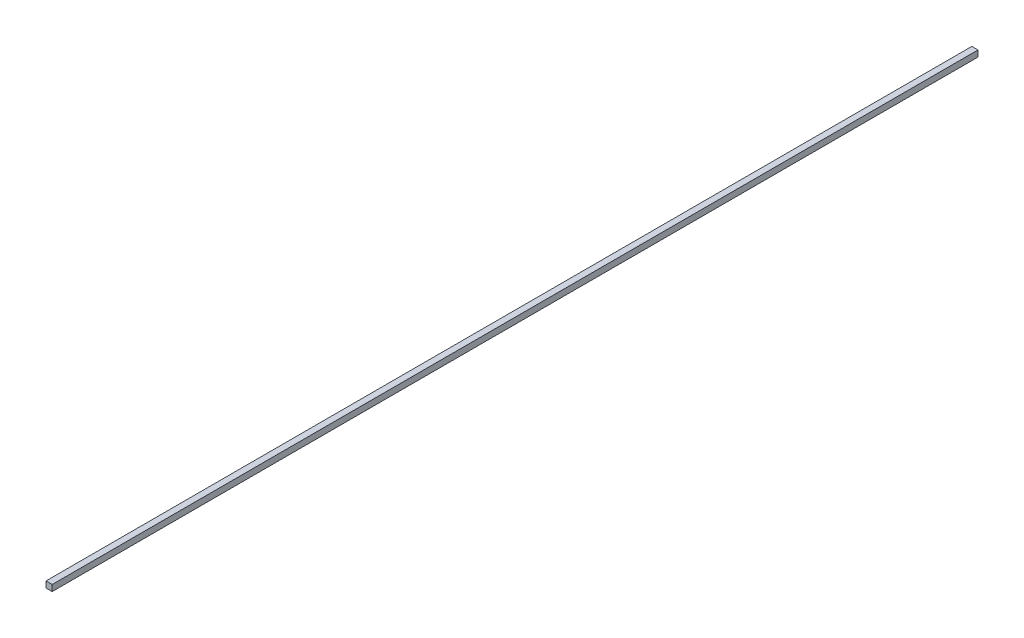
ISO-10303-21;
HEADER;
FILE_DESCRIPTION(('STEP AP214'),'2;1');
FILE_NAME('part.step','',(''),(''),'','','');
FILE_SCHEMA(('AUTOMOTIVE_DESIGN { 1 0 10303 214 1 1 1 1 }'));
ENDSEC;
DATA;
#1=APPLICATION_CONTEXT('core data for automotive mechanical design processes');
#2=APPLICATION_PROTOCOL_DEFINITION('international standard','automotive_design',2000,#1);
#3=PRODUCT_CONTEXT('',#1,'mechanical');
#4=PRODUCT('Part','Part','',(#3));
#5=PRODUCT_RELATED_PRODUCT_CATEGORY('part','',(#4));
#6=PRODUCT_DEFINITION_FORMATION('','',#4);
#7=PRODUCT_DEFINITION_CONTEXT('part definition',#1,'design');
#8=PRODUCT_DEFINITION('design','',#6,#7);
#9=PRODUCT_DEFINITION_SHAPE('','',#8);
#10=(LENGTH_UNIT() NAMED_UNIT(*) SI_UNIT(.MILLI.,.METRE.));
#11=(NAMED_UNIT(*) PLANE_ANGLE_UNIT() SI_UNIT($,.RADIAN.));
#12=(NAMED_UNIT(*) SI_UNIT($,.STERADIAN.) SOLID_ANGLE_UNIT());
#13=UNCERTAINTY_MEASURE_WITH_UNIT(LENGTH_MEASURE(1.E-05),#10,'distance_accuracy_value','');
#14=(GEOMETRIC_REPRESENTATION_CONTEXT(3) GLOBAL_UNCERTAINTY_ASSIGNED_CONTEXT((#13)) GLOBAL_UNIT_ASSIGNED_CONTEXT((#10,
#11,#12)) REPRESENTATION_CONTEXT('',''));
#15=CARTESIAN_POINT('',(0.,0.,0.));
#16=DIRECTION('',(0.,0.,1.));
#17=DIRECTION('',(1.,0.,0.));
#18=AXIS2_PLACEMENT_3D('',#15,#16,#17);
#19=CARTESIAN_POINT('',(-1.,1.,150.));
#20=DIRECTION('',(1.,0.,0.));
#21=DIRECTION('',(0.,0.,-1.));
#22=AXIS2_PLACEMENT_3D('',#19,#20,#21);
#23=PLANE('',#22);
#24=DIRECTION('',(0.,-1.,0.));
#25=VECTOR('',#24,1.);
#26=CARTESIAN_POINT('',(-1.,1.,-150.));
#27=LINE('',#26,#25);
#28=CARTESIAN_POINT('',(-1.,1.,-150.));
#29=VERTEX_POINT('',#28);
#30=CARTESIAN_POINT('',(-1.,-1.,-150.));
#31=VERTEX_POINT('',#30);
#32=EDGE_CURVE('E74',#29,#31,#27,.T.);
#33=ORIENTED_EDGE('',*,*,#32,.T.);
#34=DIRECTION('',(0.,0.,-1.));
#35=VECTOR('',#34,1.);
#36=CARTESIAN_POINT('',(-1.,-1.,150.));
#37=LINE('',#36,#35);
#38=CARTESIAN_POINT('',(-1.,-1.,150.));
#39=VERTEX_POINT('',#38);
#40=EDGE_CURVE('E11',#39,#31,#37,.T.);
#41=ORIENTED_EDGE('',*,*,#40,.F.);
#42=DIRECTION('',(0.,-1.,0.));
#43=VECTOR('',#42,1.);
#44=CARTESIAN_POINT('',(-1.,1.,150.));
#45=LINE('',#44,#43);
#46=CARTESIAN_POINT('',(-1.,1.,150.));
#47=VERTEX_POINT('',#46);
#48=EDGE_CURVE('E92',#47,#39,#45,.T.);
#49=ORIENTED_EDGE('',*,*,#48,.F.);
#50=DIRECTION('',(0.,0.,-1.));
#51=VECTOR('',#50,1.);
#52=CARTESIAN_POINT('',(-1.,1.,150.));
#53=LINE('',#52,#51);
#54=EDGE_CURVE('E86',#47,#29,#53,.T.);
#55=ORIENTED_EDGE('',*,*,#54,.T.);
#56=EDGE_LOOP('',(#33,#41,#49,#55));
#57=FACE_BOUND('',#56,.T.);
#58=ADVANCED_FACE('F30',(#57),#23,.F.);
#59=CARTESIAN_POINT('',(-1.,-1.,150.));
#60=DIRECTION('',(0.,1.,0.));
#61=DIRECTION('',(0.,0.,1.));
#62=AXIS2_PLACEMENT_3D('',#59,#60,#61);
#63=PLANE('',#62);
#64=DIRECTION('',(1.,0.,0.));
#65=VECTOR('',#64,1.);
#66=CARTESIAN_POINT('',(-1.,-1.,-150.));
#67=LINE('',#66,#65);
#68=CARTESIAN_POINT('',(1.,-1.,-150.));
#69=VERTEX_POINT('',#68);
#70=EDGE_CURVE('E70',#31,#69,#67,.T.);
#71=ORIENTED_EDGE('',*,*,#70,.T.);
#72=DIRECTION('',(0.,0.,-1.));
#73=VECTOR('',#72,1.);
#74=CARTESIAN_POINT('',(1.,-1.,150.));
#75=LINE('',#74,#73);
#76=CARTESIAN_POINT('',(1.,-1.,150.));
#77=VERTEX_POINT('',#76);
#78=EDGE_CURVE('E37',#77,#69,#75,.T.);
#79=ORIENTED_EDGE('',*,*,#78,.F.);
#80=DIRECTION('',(1.,0.,0.));
#81=VECTOR('',#80,1.);
#82=CARTESIAN_POINT('',(-1.,-1.,150.));
#83=LINE('',#82,#81);
#84=EDGE_CURVE('E82',#39,#77,#83,.T.);
#85=ORIENTED_EDGE('',*,*,#84,.F.);
#86=ORIENTED_EDGE('',*,*,#40,.T.);
#87=EDGE_LOOP('',(#71,#79,#85,#86));
#88=FACE_BOUND('',#87,.T.);
#89=ADVANCED_FACE('F81',(#88),#63,.F.);
#90=CARTESIAN_POINT('',(1.,1.,150.));
#91=DIRECTION('',(-1.,0.,0.));
#92=DIRECTION('',(0.,-1.,0.));
#93=AXIS2_PLACEMENT_3D('',#90,#91,#92);
#94=PLANE('',#93);
#95=DIRECTION('',(0.,1.,0.));
#96=VECTOR('',#95,1.);
#97=CARTESIAN_POINT('',(1.,1.,-150.));
#98=LINE('',#97,#96);
#99=CARTESIAN_POINT('',(1.,1.,-150.));
#100=VERTEX_POINT('',#99);
#101=EDGE_CURVE('E75',#69,#100,#98,.T.);
#102=ORIENTED_EDGE('',*,*,#101,.T.);
#103=DIRECTION('',(0.,0.,-1.));
#104=VECTOR('',#103,1.);
#105=CARTESIAN_POINT('',(1.,1.,150.));
#106=LINE('',#105,#104);
#107=CARTESIAN_POINT('',(1.,1.,150.));
#108=VERTEX_POINT('',#107);
#109=EDGE_CURVE('E98',#108,#100,#106,.T.);
#110=ORIENTED_EDGE('',*,*,#109,.F.);
#111=DIRECTION('',(0.,1.,0.));
#112=VECTOR('',#111,1.);
#113=CARTESIAN_POINT('',(1.,1.,150.));
#114=LINE('',#113,#112);
#115=EDGE_CURVE('E49',#77,#108,#114,.T.);
#116=ORIENTED_EDGE('',*,*,#115,.F.);
#117=ORIENTED_EDGE('',*,*,#78,.T.);
#118=EDGE_LOOP('',(#102,#110,#116,#117));
#119=FACE_BOUND('',#118,.T.);
#120=ADVANCED_FACE('F101',(#119),#94,.F.);
#121=CARTESIAN_POINT('',(-1.,1.,150.));
#122=DIRECTION('',(0.,-1.,0.));
#123=DIRECTION('',(1.,0.,0.));
#124=AXIS2_PLACEMENT_3D('',#121,#122,#123);
#125=PLANE('',#124);
#126=DIRECTION('',(-1.,0.,0.));
#127=VECTOR('',#126,1.);
#128=CARTESIAN_POINT('',(-1.,1.,-150.));
#129=LINE('',#128,#127);
#130=EDGE_CURVE('E90',#100,#29,#129,.T.);
#131=ORIENTED_EDGE('',*,*,#130,.T.);
#132=ORIENTED_EDGE('',*,*,#54,.F.);
#133=DIRECTION('',(-1.,0.,0.));
#134=VECTOR('',#133,1.);
#135=CARTESIAN_POINT('',(-1.,1.,150.));
#136=LINE('',#135,#134);
#137=EDGE_CURVE('E44',#108,#47,#136,.T.);
#138=ORIENTED_EDGE('',*,*,#137,.F.);
#139=ORIENTED_EDGE('',*,*,#109,.T.);
#140=EDGE_LOOP('',(#131,#132,#138,#139));
#141=FACE_BOUND('',#140,.T.);
#142=ADVANCED_FACE('F103',(#141),#125,.F.);
#143=CARTESIAN_POINT('',(-1.,-1.,150.));
#144=DIRECTION('',(0.,0.,1.));
#145=DIRECTION('',(1.,0.,0.));
#146=AXIS2_PLACEMENT_3D('',#143,#144,#145);
#147=PLANE('',#146);
#148=ORIENTED_EDGE('',*,*,#48,.T.);
#149=ORIENTED_EDGE('',*,*,#84,.T.);
#150=ORIENTED_EDGE('',*,*,#115,.T.);
#151=ORIENTED_EDGE('',*,*,#137,.T.);
#152=EDGE_LOOP('',(#148,#149,#150,#151));
#153=FACE_BOUND('',#152,.T.);
#154=ADVANCED_FACE('F104',(#153),#147,.T.);
#155=CARTESIAN_POINT('',(-1.,-1.,-150.));
#156=DIRECTION('',(0.,0.,1.));
#157=DIRECTION('',(1.,0.,0.));
#158=AXIS2_PLACEMENT_3D('',#155,#156,#157);
#159=PLANE('',#158);
#160=ORIENTED_EDGE('',*,*,#32,.F.);
#161=ORIENTED_EDGE('',*,*,#130,.F.);
#162=ORIENTED_EDGE('',*,*,#101,.F.);
#163=ORIENTED_EDGE('',*,*,#70,.F.);
#164=EDGE_LOOP('',(#160,#161,#162,#163));
#165=FACE_BOUND('',#164,.T.);
#166=ADVANCED_FACE('F71',(#165),#159,.F.);
#167=CLOSED_SHELL('',(#58,#89,#120,#142,#154,#166));
#168=MANIFOLD_SOLID_BREP('B2',#167);
#169=ADVANCED_BREP_SHAPE_REPRESENTATION('',(#18,#168),#14);
#170=SHAPE_DEFINITION_REPRESENTATION(#9,#169);
ENDSEC;
END-ISO-10303-21;
